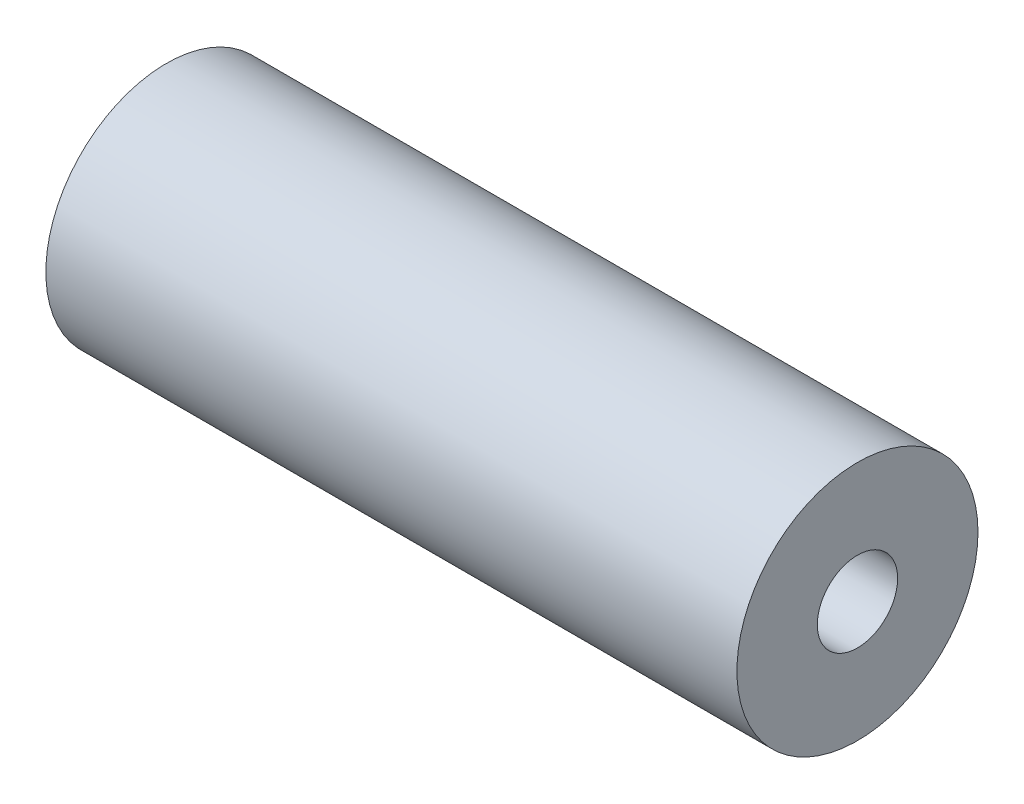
from build123d import *

# Parameters (mm, degrees)
SKETCH1_R           = 7.5
SKETCH1_R_2         = 2.5
BOSS_EXTRUDE1_DEPTH = 43


with BuildPart() as part:
    # Sketch1 → Boss-Extrude1 (new body)
    with BuildSketch(Plane(origin=(0, 0, 0), x_dir=(0, 0, -1), z_dir=(1, 0, 0))):
        Circle(SKETCH1_R)
        Circle(SKETCH1_R_2, mode=Mode.SUBTRACT)
    extrude(amount=BOSS_EXTRUDE1_DEPTH)


solid = part.part
